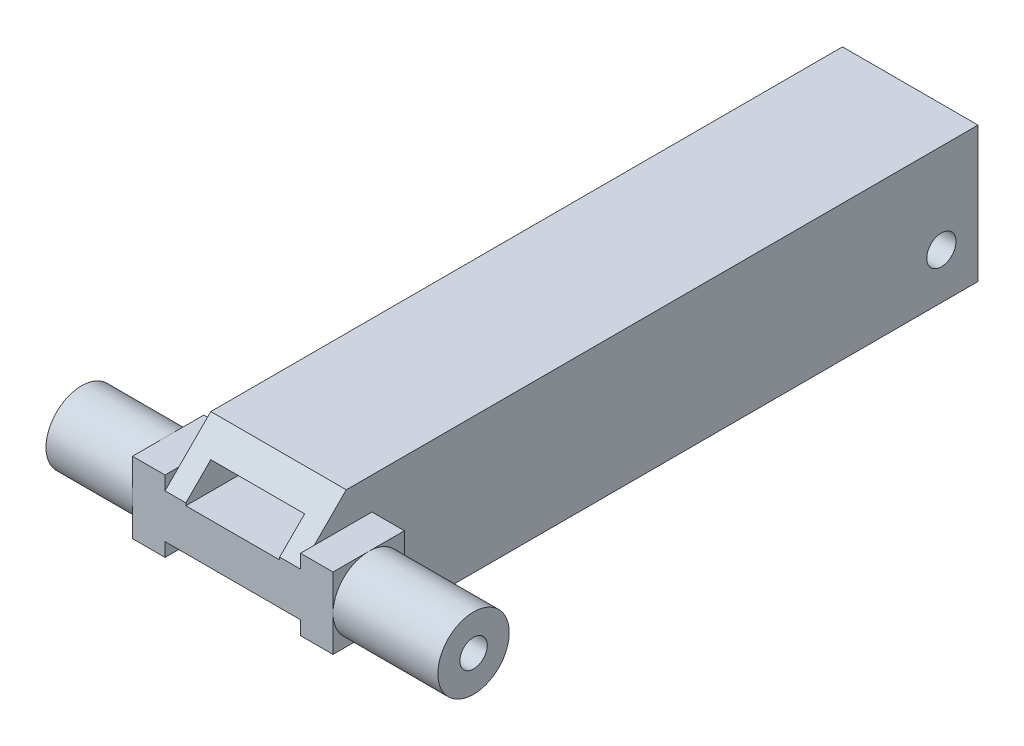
from build123d import *

# Parameters (mm, degrees)
SKETCH_1_W          = 74
SKETCH_1_H          = 14.8
EXTRUDE_1_DEPTH     = 14.8
SKETCH_2_W          = 10.25
SKETCH_2_H          = 10.25
CUT_EXTRUDE_1_DEPTH = 65
SKETCH_3_R          = 3.9
EXTRUDE_2_DEPTH     = 15
EXTRUDE_START       = 13
SKETCH_4_R          = 3.9
EXTRUDE_3_DEPTH     = 13
CHAMFER_1_SIZE      = 5
SKETCH_8_R          = 1.45
CUT_EXTRUDE_4_DEPTH = 58.057865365
SKETCH_9_W          = 7.8
SKETCH_9_H          = 7.8
SKETCH_9_R          = 1.5
EXTRUDE_4_DEPTH     = 3.55
SKETCH_10_W         = 7.8
SKETCH_10_H         = 7.8
EXTRUDE_5_DEPTH     = 3.55
SKETCH1_R           = 1.6
CUT_EXTRUDE1_DEPTH  = 49.08118135
SKETCH2_R           = 1.5
CUT_EXTRUDE2_DEPTH  = 58.057865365
SKETCH3_W           = 10.25
SKETCH3_H           = 3
CUT_EXTRUDE3_DEPTH  = 72.887411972


with BuildPart() as part:
    # Sketch 1 → Extrude 1 (new body)
    with BuildSketch(Plane(origin=(0, 0, 0), x_dir=(0, 0, -1), z_dir=(1, 0, 0))):
        Rectangle(SKETCH_1_W, SKETCH_1_H)
    extrude(amount=EXTRUDE_1_DEPTH)

    # Sketch 2 → Cut-Extrude 1 (cut)
    with BuildSketch(Plane(origin=(0, 0, -37), x_dir=(-1, 0, 0), z_dir=(0, 0, -1))):
        with Locations((-7.4, 0)):
            Rectangle(SKETCH_2_W, SKETCH_2_H)
    extrude(amount=-CUT_EXTRUDE_1_DEPTH, mode=Mode.SUBTRACT)

    # Sketch 3 → Extrude 2 (add)
    with BuildSketch(Plane(origin=(14.8, 0, 0), x_dir=(0, 0, -1), z_dir=(1, 0, 0))):
        with Locations(Location((-33.1, 0, 0), (0, 0, 180))):
            Circle(SKETCH_3_R)
    extrude(amount=EXTRUDE_2_DEPTH)

    # Sketch 4 → Extrude 3 (add)
    with BuildSketch(Plane.ZY.offset(EXTRUDE_START)):
        with Locations((33.1, 0)):
            Circle(SKETCH_4_R)
    extrude(amount=-EXTRUDE_3_DEPTH)

    # Chamfer 1
    chamfer_1_edges = [part.edges().sort_by_distance(p)[0] for p in [
        (7.4, 7.4, 37),
        (7.4, -7.4, 37),
    ]]
    chamfer(chamfer_1_edges, length=CHAMFER_1_SIZE)

    # Sketch 8 → Cut-Extrude 4 (cut, through all)
    with BuildSketch(Plane(origin=(29.8, 0, 0), x_dir=(0, 0, -1), z_dir=(1, 0, 0))):
        with Locations((-33.1, 0)):
            Circle(SKETCH_8_R)
    extrude(amount=-CUT_EXTRUDE_4_DEPTH, mode=Mode.SUBTRACT)

    # Sketch 9 → Extrude 4 (add)
    with BuildSketch(Plane.ZY):
        with Locations((33.1, 0)):
            Rectangle(SKETCH_9_W, SKETCH_9_H)
        with Locations((33.1, 0)):
            Circle(SKETCH_9_R, mode=Mode.SUBTRACT)
    extrude(amount=EXTRUDE_4_DEPTH)

    # Sketch 10 → Extrude 5 (add)
    with BuildSketch(Plane(origin=(14.8, 0, 0), x_dir=(0, 0, -1), z_dir=(1, 0, 0))):
        with Locations((-33.1, 0)):
            Rectangle(SKETCH_10_W, SKETCH_10_H)
    extrude(amount=EXTRUDE_5_DEPTH)

    # Sketch1 → Cut-Extrude1 (cut, through all)
    with BuildSketch(Plane.ZY):
        with Locations((-33, -2.4)):
            Circle(SKETCH1_R)
    extrude(amount=-CUT_EXTRUDE1_DEPTH, mode=Mode.SUBTRACT)

    # Sketch2 → Cut-Extrude2 (cut, through all)
    with BuildSketch(Plane(origin=(29.8, 0, 0), x_dir=(0, 0, -1), z_dir=(1, 0, 0))):
        with Locations((-33.1, 0)):
            Circle(SKETCH2_R)
    extrude(amount=-CUT_EXTRUDE2_DEPTH, mode=Mode.SUBTRACT)

    # Sketch3 → Cut-Extrude3 (cut, through all)
    with BuildSketch(Plane(origin=(0, 0, 28), x_dir=(-1, 0, 0), z_dir=(0, 0, -1))):
        with Locations((-7.4, 3.625)):
            Rectangle(SKETCH3_W, SKETCH3_H)
    extrude(amount=-CUT_EXTRUDE3_DEPTH, mode=Mode.SUBTRACT)


solid = part.part
